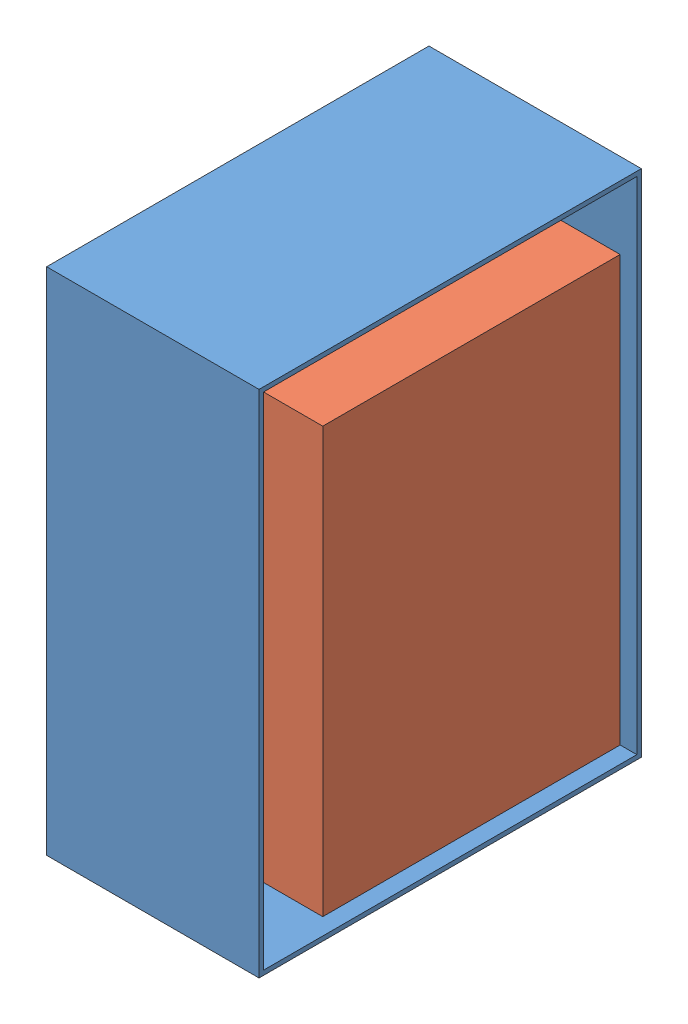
SolidWorks assembly Assembly.SLDASM, configuration Défaut (file format 11000). Lengths in mm.
Overall size (55 120 90).
2 component instances, 2 part files, 4 mates.
Components (placement in the parent):
- HeadBoxBack-1: HeadBoxBack.SLDPRT [Défaut] at (-48.904 -57.6893 120) size (50 120 90)
- HeadBox-1: HeadBox.SLDPRT [Défaut] at (6.096 -47.6893 200) x (0 0 -1) z (0 1 0) size (70 50 100)
Mates (geometry in assembly coordinates):
- Coïncidente1: coincident: plane of HeadBoxBack-1 through (-3.904 -57.6893 120) normal (1 0 0); plane of HeadBox-1 through (-3.904 -47.6893 200) normal (-1 0 0)
- Parallèle1: parallel: plane of HeadBoxBack-1 through (-43.904 -57.6893 120) normal (0 -1 0); plane of HeadBox-1 through (-43.904 52.3107 200) normal (0 1 0)
- Coïncidente3: coincident: plane of HeadBoxBack-1 through (-3.904 -37.6893 190) normal (0.173648 0 0.984808); plane of HeadBox-1 through (-3.904 -37.6893 190) normal (-0.173648 0 -0.984808)
- Coïncidente4: coincident: plane of HeadBoxBack-1 through (-3.904 42.3107 190) normal (0.173648 0.984808 0); plane of HeadBox-1 through (-3.904 42.3107 190) normal (-0.173648 -0.984808 0)
